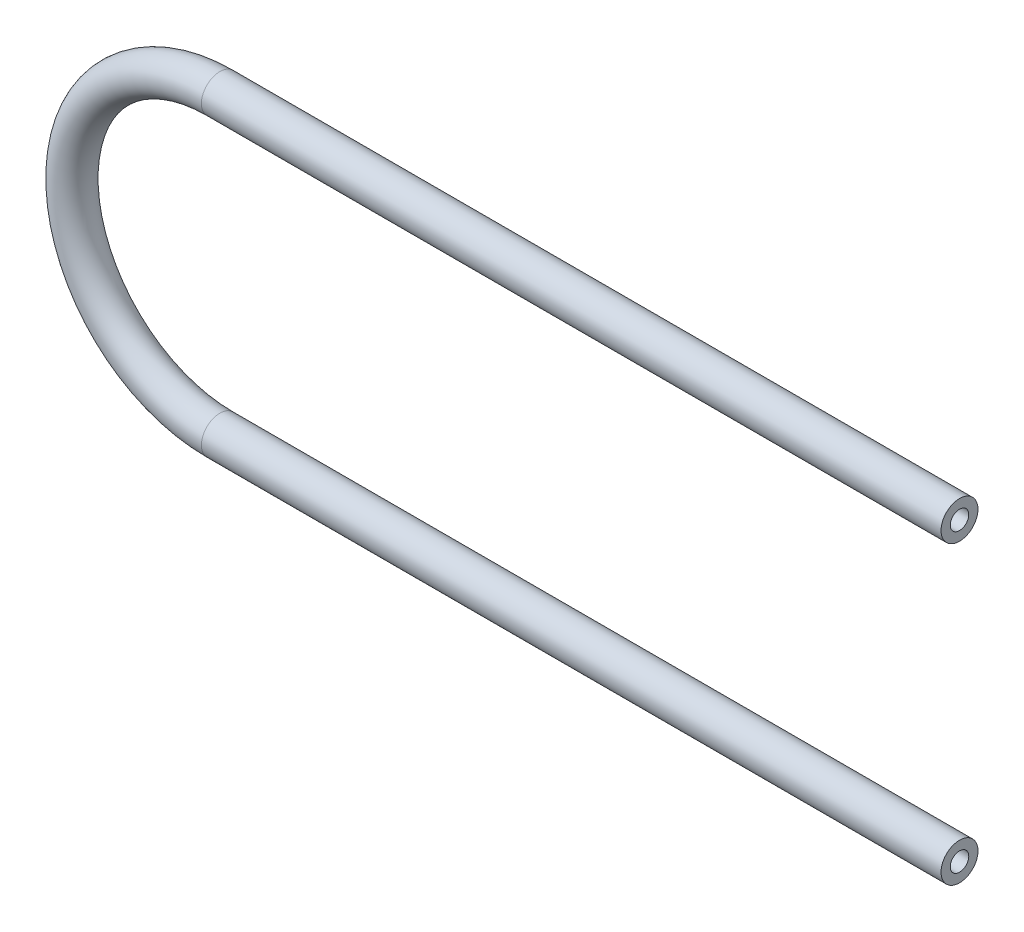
ISO-10303-21;
HEADER;
FILE_DESCRIPTION(('STEP AP214'),'2;1');
FILE_NAME('part.step','',(''),(''),'','','');
FILE_SCHEMA(('AUTOMOTIVE_DESIGN { 1 0 10303 214 1 1 1 1 }'));
ENDSEC;
DATA;
#1=APPLICATION_CONTEXT('core data for automotive mechanical design processes');
#2=APPLICATION_PROTOCOL_DEFINITION('international standard','automotive_design',2000,#1);
#3=PRODUCT_CONTEXT('',#1,'mechanical');
#4=PRODUCT('Part','Part','',(#3));
#5=PRODUCT_RELATED_PRODUCT_CATEGORY('part','',(#4));
#6=PRODUCT_DEFINITION_FORMATION('','',#4);
#7=PRODUCT_DEFINITION_CONTEXT('part definition',#1,'design');
#8=PRODUCT_DEFINITION('design','',#6,#7);
#9=PRODUCT_DEFINITION_SHAPE('','',#8);
#10=(LENGTH_UNIT() NAMED_UNIT(*) SI_UNIT(.MILLI.,.METRE.));
#11=(NAMED_UNIT(*) PLANE_ANGLE_UNIT() SI_UNIT($,.RADIAN.));
#12=(NAMED_UNIT(*) SI_UNIT($,.STERADIAN.) SOLID_ANGLE_UNIT());
#13=UNCERTAINTY_MEASURE_WITH_UNIT(LENGTH_MEASURE(1.E-05),#10,'distance_accuracy_value','');
#14=(GEOMETRIC_REPRESENTATION_CONTEXT(3) GLOBAL_UNCERTAINTY_ASSIGNED_CONTEXT((#13)) GLOBAL_UNIT_ASSIGNED_CONTEXT((#10,
#11,#12)) REPRESENTATION_CONTEXT('',''));
#15=CARTESIAN_POINT('',(0.,0.,0.));
#16=DIRECTION('',(0.,0.,1.));
#17=DIRECTION('',(1.,0.,0.));
#18=AXIS2_PLACEMENT_3D('',#15,#16,#17);
#19=CARTESIAN_POINT('',(0.,0.,0.));
#20=DIRECTION('',(0.,0.,-1.));
#21=DIRECTION('',(-1.,0.,0.));
#22=AXIS2_PLACEMENT_3D('',#19,#20,#21);
#23=TOROIDAL_SURFACE('',#22,25.4,1.5875);
#24=CARTESIAN_POINT('',(0.,-25.4,0.));
#25=DIRECTION('',(-1.,0.,0.));
#26=DIRECTION('',(0.,0.,-1.));
#27=AXIS2_PLACEMENT_3D('',#24,#25,#26);
#28=CIRCLE('',#27,1.5875);
#29=CARTESIAN_POINT('',(0.,-26.9875,0.));
#30=VERTEX_POINT('',#29);
#31=EDGE_CURVE('E52',#30,#30,#28,.T.);
#32=CARTESIAN_POINT('',(0.,25.4,0.));
#33=DIRECTION('',(1.,0.,0.));
#34=DIRECTION('',(0.,0.,-1.));
#35=AXIS2_PLACEMENT_3D('',#32,#33,#34);
#36=CIRCLE('',#35,1.5875);
#37=CARTESIAN_POINT('',(0.,26.9875,0.));
#38=VERTEX_POINT('',#37);
#39=EDGE_CURVE('E62',#38,#38,#36,.T.);
#40=CARTESIAN_POINT('',(0.,0.,0.));
#41=DIRECTION('',(0.,0.,-1.));
#42=DIRECTION('',(-1.,0.,0.));
#43=AXIS2_PLACEMENT_3D('',#40,#41,#42);
#44=CIRCLE('',#43,26.9875);
#45=EDGE_CURVE('',#30,#38,#44,.T.);
#46=ORIENTED_EDGE('',*,*,#31,.F.);
#47=ORIENTED_EDGE('',*,*,#39,.T.);
#48=ORIENTED_EDGE('',*,*,#45,.T.);
#49=ORIENTED_EDGE('',*,*,#45,.F.);
#50=EDGE_LOOP('',(#46,#48,#47,#49));
#51=FACE_BOUND('',#50,.T.);
#52=ADVANCED_FACE('F44',(#51),#23,.F.);
#53=CARTESIAN_POINT('',(0.,0.,0.));
#54=DIRECTION('',(0.,0.,-1.));
#55=DIRECTION('',(-1.,0.,0.));
#56=AXIS2_PLACEMENT_3D('',#53,#54,#55);
#57=TOROIDAL_SURFACE('',#56,25.4,3.175);
#58=CARTESIAN_POINT('',(0.,-25.4,0.));
#59=DIRECTION('',(-1.,0.,0.));
#60=DIRECTION('',(0.,0.,-1.));
#61=AXIS2_PLACEMENT_3D('',#58,#59,#60);
#62=CIRCLE('',#61,3.175);
#63=CARTESIAN_POINT('',(0.,-28.575,0.));
#64=VERTEX_POINT('',#63);
#65=EDGE_CURVE('E10',#64,#64,#62,.T.);
#66=CARTESIAN_POINT('',(0.,25.4,0.));
#67=DIRECTION('',(1.,0.,0.));
#68=DIRECTION('',(0.,0.,-1.));
#69=AXIS2_PLACEMENT_3D('',#66,#67,#68);
#70=CIRCLE('',#69,3.175);
#71=CARTESIAN_POINT('',(0.,28.575,0.));
#72=VERTEX_POINT('',#71);
#73=EDGE_CURVE('E56',#72,#72,#70,.T.);
#74=CARTESIAN_POINT('',(0.,0.,0.));
#75=DIRECTION('',(0.,0.,-1.));
#76=DIRECTION('',(-1.,0.,0.));
#77=AXIS2_PLACEMENT_3D('',#74,#75,#76);
#78=CIRCLE('',#77,28.575);
#79=EDGE_CURVE('',#64,#72,#78,.T.);
#80=ORIENTED_EDGE('',*,*,#65,.T.);
#81=ORIENTED_EDGE('',*,*,#73,.F.);
#82=ORIENTED_EDGE('',*,*,#79,.T.);
#83=ORIENTED_EDGE('',*,*,#79,.F.);
#84=EDGE_LOOP('',(#80,#82,#81,#83));
#85=FACE_BOUND('',#84,.T.);
#86=ADVANCED_FACE('F50',(#85),#57,.T.);
#87=CARTESIAN_POINT('',(127.,-25.4,0.));
#88=DIRECTION('',(1.,0.,0.));
#89=DIRECTION('',(0.,0.,-1.));
#90=AXIS2_PLACEMENT_3D('',#87,#88,#89);
#91=PLANE('',#90);
#92=CARTESIAN_POINT('',(127.,-25.4,0.));
#93=DIRECTION('',(1.,0.,0.));
#94=DIRECTION('',(0.,0.,-1.));
#95=AXIS2_PLACEMENT_3D('',#92,#93,#94);
#96=CIRCLE('',#95,3.175);
#97=CARTESIAN_POINT('',(127.,-25.4,-3.175));
#98=VERTEX_POINT('',#97);
#99=EDGE_CURVE('E72',#98,#98,#96,.T.);
#100=ORIENTED_EDGE('',*,*,#99,.T.);
#101=EDGE_LOOP('',(#100));
#102=FACE_BOUND('',#101,.T.);
#103=CARTESIAN_POINT('',(127.,-25.4,0.));
#104=DIRECTION('',(1.,0.,0.));
#105=DIRECTION('',(0.,0.,-1.));
#106=AXIS2_PLACEMENT_3D('',#103,#104,#105);
#107=CIRCLE('',#106,1.5875);
#108=CARTESIAN_POINT('',(127.,-25.4,-1.5875));
#109=VERTEX_POINT('',#108);
#110=EDGE_CURVE('E73',#109,#109,#107,.T.);
#111=ORIENTED_EDGE('',*,*,#110,.F.);
#112=EDGE_LOOP('',(#111));
#113=FACE_BOUND('',#112,.T.);
#114=ADVANCED_FACE('F113',(#102,#113),#91,.T.);
#115=CARTESIAN_POINT('',(127.,-25.4,0.));
#116=DIRECTION('',(-1.,0.,0.));
#117=DIRECTION('',(0.,0.,1.));
#118=AXIS2_PLACEMENT_3D('',#115,#116,#117);
#119=CYLINDRICAL_SURFACE('',#118,3.175);
#120=ORIENTED_EDGE('',*,*,#99,.F.);
#121=EDGE_LOOP('',(#120));
#122=FACE_BOUND('',#121,.T.);
#123=ORIENTED_EDGE('',*,*,#65,.F.);
#124=EDGE_LOOP('',(#123));
#125=FACE_BOUND('',#124,.T.);
#126=ADVANCED_FACE('F104',(#122,#125),#119,.T.);
#127=CARTESIAN_POINT('',(127.,-25.4,0.));
#128=DIRECTION('',(-1.,0.,0.));
#129=DIRECTION('',(0.,0.,1.));
#130=AXIS2_PLACEMENT_3D('',#127,#128,#129);
#131=CYLINDRICAL_SURFACE('',#130,1.5875);
#132=ORIENTED_EDGE('',*,*,#110,.T.);
#133=EDGE_LOOP('',(#132));
#134=FACE_BOUND('',#133,.T.);
#135=ORIENTED_EDGE('',*,*,#31,.T.);
#136=EDGE_LOOP('',(#135));
#137=FACE_BOUND('',#136,.T.);
#138=ADVANCED_FACE('F92',(#134,#137),#131,.F.);
#139=CARTESIAN_POINT('',(127.,25.4,0.));
#140=DIRECTION('',(1.,0.,0.));
#141=DIRECTION('',(0.,0.,-1.));
#142=AXIS2_PLACEMENT_3D('',#139,#140,#141);
#143=PLANE('',#142);
#144=CARTESIAN_POINT('',(127.,25.4,0.));
#145=DIRECTION('',(1.,0.,0.));
#146=DIRECTION('',(0.,0.,-1.));
#147=AXIS2_PLACEMENT_3D('',#144,#145,#146);
#148=CIRCLE('',#147,3.175);
#149=CARTESIAN_POINT('',(127.,25.4,-3.175));
#150=VERTEX_POINT('',#149);
#151=EDGE_CURVE('E76',#150,#150,#148,.T.);
#152=ORIENTED_EDGE('',*,*,#151,.T.);
#153=EDGE_LOOP('',(#152));
#154=FACE_BOUND('',#153,.T.);
#155=CARTESIAN_POINT('',(127.,25.4,0.));
#156=DIRECTION('',(1.,0.,0.));
#157=DIRECTION('',(0.,0.,-1.));
#158=AXIS2_PLACEMENT_3D('',#155,#156,#157);
#159=CIRCLE('',#158,1.5875);
#160=CARTESIAN_POINT('',(127.,25.4,-1.5875));
#161=VERTEX_POINT('',#160);
#162=EDGE_CURVE('E83',#161,#161,#159,.T.);
#163=ORIENTED_EDGE('',*,*,#162,.F.);
#164=EDGE_LOOP('',(#163));
#165=FACE_BOUND('',#164,.T.);
#166=ADVANCED_FACE('F95',(#154,#165),#143,.T.);
#167=CARTESIAN_POINT('',(127.,25.4,0.));
#168=DIRECTION('',(-1.,0.,0.));
#169=DIRECTION('',(0.,0.,1.));
#170=AXIS2_PLACEMENT_3D('',#167,#168,#169);
#171=CYLINDRICAL_SURFACE('',#170,3.175);
#172=ORIENTED_EDGE('',*,*,#151,.F.);
#173=EDGE_LOOP('',(#172));
#174=FACE_BOUND('',#173,.T.);
#175=ORIENTED_EDGE('',*,*,#73,.T.);
#176=EDGE_LOOP('',(#175));
#177=FACE_BOUND('',#176,.T.);
#178=ADVANCED_FACE('F94',(#174,#177),#171,.T.);
#179=CARTESIAN_POINT('',(127.,25.4,0.));
#180=DIRECTION('',(-1.,0.,0.));
#181=DIRECTION('',(0.,0.,1.));
#182=AXIS2_PLACEMENT_3D('',#179,#180,#181);
#183=CYLINDRICAL_SURFACE('',#182,1.5875);
#184=ORIENTED_EDGE('',*,*,#162,.T.);
#185=EDGE_LOOP('',(#184));
#186=FACE_BOUND('',#185,.T.);
#187=ORIENTED_EDGE('',*,*,#39,.F.);
#188=EDGE_LOOP('',(#187));
#189=FACE_BOUND('',#188,.T.);
#190=ADVANCED_FACE('F90',(#186,#189),#183,.F.);
#191=CLOSED_SHELL('',(#52,#86,#114,#126,#138,#166,#178,#190));
#192=MANIFOLD_SOLID_BREP('B2',#191);
#193=ADVANCED_BREP_SHAPE_REPRESENTATION('',(#18,#192),#14);
#194=SHAPE_DEFINITION_REPRESENTATION(#9,#193);
ENDSEC;
END-ISO-10303-21;
